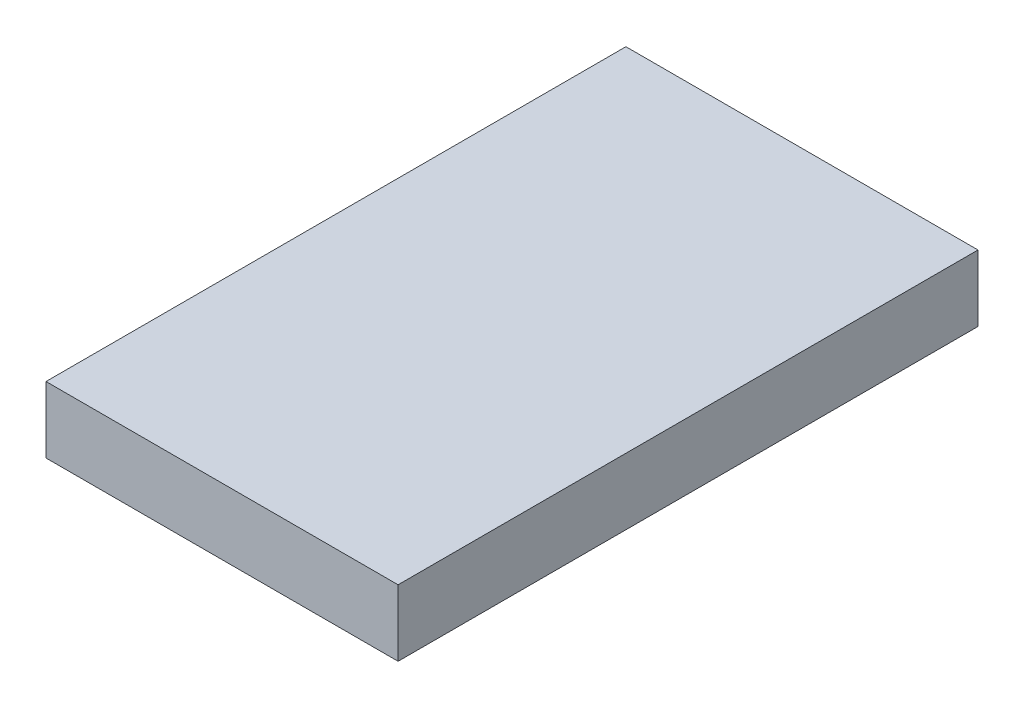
from build123d import *

# Parameters (mm, degrees)
SKETCH_1_W      = 85
SKETCH_1_H      = 16
EXTRUDE_2_DEPTH = 70


with BuildPart() as part:
    # Sketch 1 → Extrude 2 (new, symmetric)
    with BuildSketch(Plane.XY):
        with Locations((-42.5, 8)):
            Rectangle(SKETCH_1_W, SKETCH_1_H)
    extrude(amount=EXTRUDE_2_DEPTH, both=True)


solid = part.part
